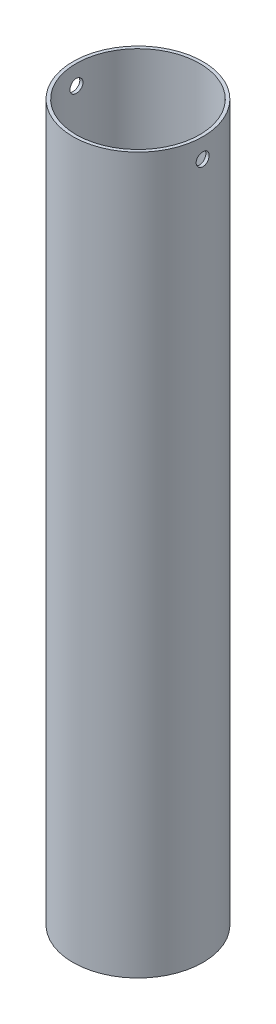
from build123d import *

# Parameters (mm, degrees)
SKETCH_1_R          = 10
SKETCH_1_R_2        = 9.5
EXTRUDE_1_DEPTH     = 110
SKETCH_2_R          = 1
CUT_EXTRUDE_1_DEPTH = 15


with BuildPart() as part:
    # Sketch 1 → Extrude 1 (new body)
    with BuildSketch(Plane(origin=(0, 0, 0), x_dir=(1, 0, 0), z_dir=(0, 1, 0))):
        with Locations(Location((0, 0, 0), (0, 0, 270))):
            Circle(SKETCH_1_R)
        with Locations(Location((0, 0, 0), (0, 0, 270))):
            Circle(SKETCH_1_R_2, mode=Mode.SUBTRACT)
    extrude(amount=-EXTRUDE_1_DEPTH)

    # Sketch 2 → Cut-Extrude 1 (cut, symmetric)
    with BuildSketch(Plane(origin=(0, 0, 0), x_dir=(0, 0, -1), z_dir=(1, 0, 0))):
        with Locations((0, -3)):
            Circle(SKETCH_2_R)
    extrude(amount=CUT_EXTRUDE_1_DEPTH, both=True, mode=Mode.SUBTRACT)


solid = part.part
